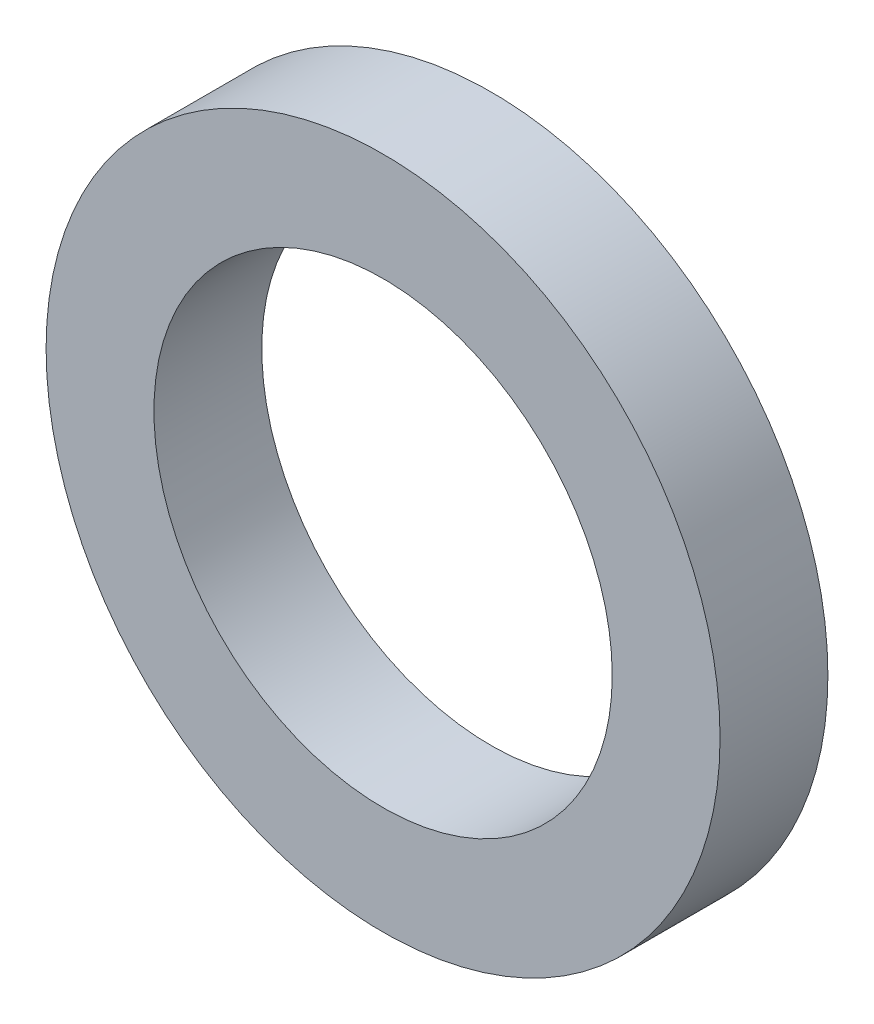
ISO-10303-21;
HEADER;
FILE_DESCRIPTION(('STEP AP214'),'2;1');
FILE_NAME('part.step','',(''),(''),'','','');
FILE_SCHEMA(('AUTOMOTIVE_DESIGN { 1 0 10303 214 1 1 1 1 }'));
ENDSEC;
DATA;
#1=APPLICATION_CONTEXT('core data for automotive mechanical design processes');
#2=APPLICATION_PROTOCOL_DEFINITION('international standard','automotive_design',2000,#1);
#3=PRODUCT_CONTEXT('',#1,'mechanical');
#4=PRODUCT('Part','Part','',(#3));
#5=PRODUCT_RELATED_PRODUCT_CATEGORY('part','',(#4));
#6=PRODUCT_DEFINITION_FORMATION('','',#4);
#7=PRODUCT_DEFINITION_CONTEXT('part definition',#1,'design');
#8=PRODUCT_DEFINITION('design','',#6,#7);
#9=PRODUCT_DEFINITION_SHAPE('','',#8);
#10=(LENGTH_UNIT() NAMED_UNIT(*) SI_UNIT(.MILLI.,.METRE.));
#11=(NAMED_UNIT(*) PLANE_ANGLE_UNIT() SI_UNIT($,.RADIAN.));
#12=(NAMED_UNIT(*) SI_UNIT($,.STERADIAN.) SOLID_ANGLE_UNIT());
#13=UNCERTAINTY_MEASURE_WITH_UNIT(LENGTH_MEASURE(1.E-05),#10,'distance_accuracy_value','');
#14=(GEOMETRIC_REPRESENTATION_CONTEXT(3) GLOBAL_UNCERTAINTY_ASSIGNED_CONTEXT((#13)) GLOBAL_UNIT_ASSIGNED_CONTEXT((#10,
#11,#12)) REPRESENTATION_CONTEXT('',''));
#15=CARTESIAN_POINT('',(0.,0.,0.));
#16=DIRECTION('',(0.,0.,1.));
#17=DIRECTION('',(1.,0.,0.));
#18=AXIS2_PLACEMENT_3D('',#15,#16,#17);
#19=CARTESIAN_POINT('',(0.,0.,4.));
#20=DIRECTION('',(0.,0.,1.));
#21=DIRECTION('',(1.,0.,0.));
#22=AXIS2_PLACEMENT_3D('',#19,#20,#21);
#23=PLANE('',#22);
#24=CARTESIAN_POINT('',(0.,0.,4.));
#25=DIRECTION('',(0.,0.,1.));
#26=DIRECTION('',(1.,0.,0.));
#27=AXIS2_PLACEMENT_3D('',#24,#25,#26);
#28=CIRCLE('',#27,12.5);
#29=CARTESIAN_POINT('',(12.5,0.,4.));
#30=VERTEX_POINT('',#29);
#31=EDGE_CURVE('E8',#30,#30,#28,.T.);
#32=ORIENTED_EDGE('',*,*,#31,.T.);
#33=EDGE_LOOP('',(#32));
#34=FACE_BOUND('',#33,.T.);
#35=CARTESIAN_POINT('',(0.,0.,4.));
#36=DIRECTION('',(0.,0.,1.));
#37=DIRECTION('',(1.,0.,0.));
#38=AXIS2_PLACEMENT_3D('',#35,#36,#37);
#39=CIRCLE('',#38,8.5);
#40=CARTESIAN_POINT('',(8.5,0.,4.));
#41=VERTEX_POINT('',#40);
#42=EDGE_CURVE('E23',#41,#41,#39,.T.);
#43=ORIENTED_EDGE('',*,*,#42,.F.);
#44=EDGE_LOOP('',(#43));
#45=FACE_BOUND('',#44,.T.);
#46=ADVANCED_FACE('F12',(#34,#45),#23,.T.);
#47=CARTESIAN_POINT('',(0.,0.,0.));
#48=DIRECTION('',(0.,0.,1.));
#49=DIRECTION('',(1.,0.,0.));
#50=AXIS2_PLACEMENT_3D('',#47,#48,#49);
#51=PLANE('',#50);
#52=CARTESIAN_POINT('',(0.,0.,0.));
#53=DIRECTION('',(0.,0.,1.));
#54=DIRECTION('',(1.,0.,0.));
#55=AXIS2_PLACEMENT_3D('',#52,#53,#54);
#56=CIRCLE('',#55,12.5);
#57=CARTESIAN_POINT('',(12.5,0.,0.));
#58=VERTEX_POINT('',#57);
#59=EDGE_CURVE('E19',#58,#58,#56,.T.);
#60=ORIENTED_EDGE('',*,*,#59,.F.);
#61=EDGE_LOOP('',(#60));
#62=FACE_BOUND('',#61,.T.);
#63=CARTESIAN_POINT('',(0.,0.,0.));
#64=DIRECTION('',(0.,0.,1.));
#65=DIRECTION('',(1.,0.,0.));
#66=AXIS2_PLACEMENT_3D('',#63,#64,#65);
#67=CIRCLE('',#66,8.5);
#68=CARTESIAN_POINT('',(8.5,0.,0.));
#69=VERTEX_POINT('',#68);
#70=EDGE_CURVE('E27',#69,#69,#67,.T.);
#71=ORIENTED_EDGE('',*,*,#70,.T.);
#72=EDGE_LOOP('',(#71));
#73=FACE_BOUND('',#72,.T.);
#74=ADVANCED_FACE('F33',(#62,#73),#51,.F.);
#75=CARTESIAN_POINT('',(0.,0.,4.));
#76=DIRECTION('',(0.,0.,-1.));
#77=DIRECTION('',(-1.,0.,0.));
#78=AXIS2_PLACEMENT_3D('',#75,#76,#77);
#79=CYLINDRICAL_SURFACE('',#78,12.5);
#80=ORIENTED_EDGE('',*,*,#31,.F.);
#81=EDGE_LOOP('',(#80));
#82=FACE_BOUND('',#81,.T.);
#83=ORIENTED_EDGE('',*,*,#59,.T.);
#84=EDGE_LOOP('',(#83));
#85=FACE_BOUND('',#84,.T.);
#86=ADVANCED_FACE('F14',(#82,#85),#79,.T.);
#87=CARTESIAN_POINT('',(0.,0.,4.));
#88=DIRECTION('',(0.,0.,-1.));
#89=DIRECTION('',(-1.,0.,0.));
#90=AXIS2_PLACEMENT_3D('',#87,#88,#89);
#91=CYLINDRICAL_SURFACE('',#90,8.5);
#92=ORIENTED_EDGE('',*,*,#42,.T.);
#93=EDGE_LOOP('',(#92));
#94=FACE_BOUND('',#93,.T.);
#95=ORIENTED_EDGE('',*,*,#70,.F.);
#96=EDGE_LOOP('',(#95));
#97=FACE_BOUND('',#96,.T.);
#98=ADVANCED_FACE('F35',(#94,#97),#91,.F.);
#99=CLOSED_SHELL('',(#46,#74,#86,#98));
#100=MANIFOLD_SOLID_BREP('B1',#99);
#101=ADVANCED_BREP_SHAPE_REPRESENTATION('',(#18,#100),#14);
#102=SHAPE_DEFINITION_REPRESENTATION(#9,#101);
ENDSEC;
END-ISO-10303-21;
